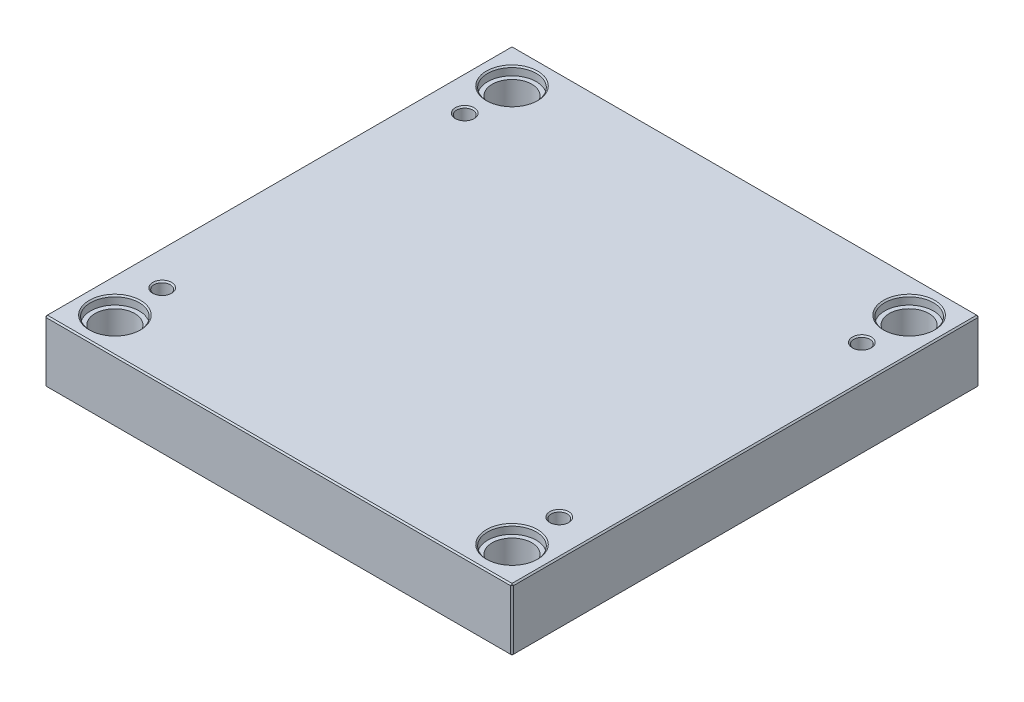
ISO-10303-21;
HEADER;
FILE_DESCRIPTION(('STEP AP214'),'2;1');
FILE_NAME('part.step','',(''),(''),'','','');
FILE_SCHEMA(('AUTOMOTIVE_DESIGN { 1 0 10303 214 1 1 1 1 }'));
ENDSEC;
DATA;
#1=APPLICATION_CONTEXT('core data for automotive mechanical design processes');
#2=APPLICATION_PROTOCOL_DEFINITION('international standard','automotive_design',2000,#1);
#3=PRODUCT_CONTEXT('',#1,'mechanical');
#4=PRODUCT('Part','Part','',(#3));
#5=PRODUCT_RELATED_PRODUCT_CATEGORY('part','',(#4));
#6=PRODUCT_DEFINITION_FORMATION('','',#4);
#7=PRODUCT_DEFINITION_CONTEXT('part definition',#1,'design');
#8=PRODUCT_DEFINITION('design','',#6,#7);
#9=PRODUCT_DEFINITION_SHAPE('','',#8);
#10=(LENGTH_UNIT() NAMED_UNIT(*) SI_UNIT(.MILLI.,.METRE.));
#11=(NAMED_UNIT(*) PLANE_ANGLE_UNIT() SI_UNIT($,.RADIAN.));
#12=(NAMED_UNIT(*) SI_UNIT($,.STERADIAN.) SOLID_ANGLE_UNIT());
#13=UNCERTAINTY_MEASURE_WITH_UNIT(LENGTH_MEASURE(1.E-05),#10,'distance_accuracy_value','');
#14=(GEOMETRIC_REPRESENTATION_CONTEXT(3) GLOBAL_UNCERTAINTY_ASSIGNED_CONTEXT((#13)) GLOBAL_UNIT_ASSIGNED_CONTEXT((#10,
#11,#12)) REPRESENTATION_CONTEXT('',''));
#15=CARTESIAN_POINT('',(0.,0.,0.));
#16=DIRECTION('',(0.,0.,1.));
#17=DIRECTION('',(1.,0.,0.));
#18=AXIS2_PLACEMENT_3D('',#15,#16,#17);
#19=CARTESIAN_POINT('',(-147.,0.,-147.));
#20=DIRECTION('',(0.,1.,0.));
#21=DIRECTION('',(0.,0.,1.));
#22=AXIS2_PLACEMENT_3D('',#19,#20,#21);
#23=CYLINDRICAL_SURFACE('',#22,14.7);
#24=CARTESIAN_POINT('',(-147.,0.999999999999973,-147.));
#25=DIRECTION('',(0.,1.,0.));
#26=DIRECTION('',(0.,0.,1.));
#27=AXIS2_PLACEMENT_3D('',#24,#25,#26);
#28=CIRCLE('',#27,14.7);
#29=CARTESIAN_POINT('',(-147.,0.999999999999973,-132.3));
#30=VERTEX_POINT('',#29);
#31=EDGE_CURVE('E472',#30,#30,#28,.F.);
#32=ORIENTED_EDGE('',*,*,#31,.T.);
#33=EDGE_LOOP('',(#32));
#34=FACE_BOUND('',#33,.T.);
#35=CARTESIAN_POINT('',(-147.,39.7,-147.));
#36=DIRECTION('',(0.,1.,0.));
#37=DIRECTION('',(0.,0.,1.));
#38=AXIS2_PLACEMENT_3D('',#35,#36,#37);
#39=CIRCLE('',#38,14.7);
#40=CARTESIAN_POINT('',(-147.,39.7,-132.3));
#41=VERTEX_POINT('',#40);
#42=EDGE_CURVE('E221',#41,#41,#39,.F.);
#43=ORIENTED_EDGE('',*,*,#42,.F.);
#44=EDGE_LOOP('',(#43));
#45=FACE_BOUND('',#44,.T.);
#46=ADVANCED_FACE('F16',(#34,#45),#23,.F.);
#47=CARTESIAN_POINT('',(147.,0.,-147.));
#48=DIRECTION('',(0.,1.,0.));
#49=DIRECTION('',(0.,0.,1.));
#50=AXIS2_PLACEMENT_3D('',#47,#48,#49);
#51=CYLINDRICAL_SURFACE('',#50,14.7);
#52=CARTESIAN_POINT('',(147.,0.999999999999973,-147.));
#53=DIRECTION('',(0.,1.,0.));
#54=DIRECTION('',(0.,0.,1.));
#55=AXIS2_PLACEMENT_3D('',#52,#53,#54);
#56=CIRCLE('',#55,14.7);
#57=CARTESIAN_POINT('',(147.,0.999999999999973,-132.3));
#58=VERTEX_POINT('',#57);
#59=EDGE_CURVE('E474',#58,#58,#56,.F.);
#60=ORIENTED_EDGE('',*,*,#59,.T.);
#61=EDGE_LOOP('',(#60));
#62=FACE_BOUND('',#61,.T.);
#63=CARTESIAN_POINT('',(147.,39.7,-147.));
#64=DIRECTION('',(0.,1.,0.));
#65=DIRECTION('',(0.,0.,1.));
#66=AXIS2_PLACEMENT_3D('',#63,#64,#65);
#67=CIRCLE('',#66,14.7);
#68=CARTESIAN_POINT('',(147.,39.7,-132.3));
#69=VERTEX_POINT('',#68);
#70=EDGE_CURVE('E218',#69,#69,#67,.F.);
#71=ORIENTED_EDGE('',*,*,#70,.F.);
#72=EDGE_LOOP('',(#71));
#73=FACE_BOUND('',#72,.T.);
#74=ADVANCED_FACE('F263',(#62,#73),#51,.F.);
#75=CARTESIAN_POINT('',(147.,0.,147.));
#76=DIRECTION('',(0.,1.,0.));
#77=DIRECTION('',(0.,0.,1.));
#78=AXIS2_PLACEMENT_3D('',#75,#76,#77);
#79=CYLINDRICAL_SURFACE('',#78,14.7);
#80=CARTESIAN_POINT('',(147.,0.999999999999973,147.));
#81=DIRECTION('',(0.,1.,0.));
#82=DIRECTION('',(0.,0.,1.));
#83=AXIS2_PLACEMENT_3D('',#80,#81,#82);
#84=CIRCLE('',#83,14.7);
#85=CARTESIAN_POINT('',(147.,0.999999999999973,161.7));
#86=VERTEX_POINT('',#85);
#87=EDGE_CURVE('E477',#86,#86,#84,.F.);
#88=ORIENTED_EDGE('',*,*,#87,.T.);
#89=EDGE_LOOP('',(#88));
#90=FACE_BOUND('',#89,.T.);
#91=CARTESIAN_POINT('',(147.,39.7,147.));
#92=DIRECTION('',(0.,1.,0.));
#93=DIRECTION('',(0.,0.,1.));
#94=AXIS2_PLACEMENT_3D('',#91,#92,#93);
#95=CIRCLE('',#94,14.7);
#96=CARTESIAN_POINT('',(147.,39.7,161.7));
#97=VERTEX_POINT('',#96);
#98=EDGE_CURVE('E214',#97,#97,#95,.F.);
#99=ORIENTED_EDGE('',*,*,#98,.F.);
#100=EDGE_LOOP('',(#99));
#101=FACE_BOUND('',#100,.T.);
#102=ADVANCED_FACE('F270',(#90,#101),#79,.F.);
#103=CARTESIAN_POINT('',(-147.,0.,147.));
#104=DIRECTION('',(0.,1.,0.));
#105=DIRECTION('',(0.,0.,1.));
#106=AXIS2_PLACEMENT_3D('',#103,#104,#105);
#107=CYLINDRICAL_SURFACE('',#106,14.7);
#108=CARTESIAN_POINT('',(-147.,0.999999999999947,147.));
#109=DIRECTION('',(0.,1.,0.));
#110=DIRECTION('',(0.,0.,1.));
#111=AXIS2_PLACEMENT_3D('',#108,#109,#110);
#112=CIRCLE('',#111,14.7);
#113=CARTESIAN_POINT('',(-147.,0.999999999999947,161.7));
#114=VERTEX_POINT('',#113);
#115=EDGE_CURVE('E480',#114,#114,#112,.F.);
#116=ORIENTED_EDGE('',*,*,#115,.T.);
#117=EDGE_LOOP('',(#116));
#118=FACE_BOUND('',#117,.T.);
#119=CARTESIAN_POINT('',(-147.,39.7,147.));
#120=DIRECTION('',(0.,1.,0.));
#121=DIRECTION('',(0.,0.,1.));
#122=AXIS2_PLACEMENT_3D('',#119,#120,#121);
#123=CIRCLE('',#122,14.7);
#124=CARTESIAN_POINT('',(-147.,39.7,161.7));
#125=VERTEX_POINT('',#124);
#126=EDGE_CURVE('E211',#125,#125,#123,.F.);
#127=ORIENTED_EDGE('',*,*,#126,.F.);
#128=EDGE_LOOP('',(#127));
#129=FACE_BOUND('',#128,.T.);
#130=ADVANCED_FACE('F277',(#118,#129),#107,.F.);
#131=CARTESIAN_POINT('',(-173.,46.,173.));
#132=DIRECTION('',(1.,0.,0.));
#133=DIRECTION('',(0.,0.,-1.));
#134=AXIS2_PLACEMENT_3D('',#131,#132,#133);
#135=PLANE('',#134);
#136=DIRECTION('',(0.,-1.,0.));
#137=VECTOR('',#136,1.);
#138=CARTESIAN_POINT('',(-173.,46.,-172.));
#139=LINE('',#138,#137);
#140=CARTESIAN_POINT('',(-173.,45.,-172.));
#141=VERTEX_POINT('',#140);
#142=CARTESIAN_POINT('',(-173.,1.,-172.));
#143=VERTEX_POINT('',#142);
#144=EDGE_CURVE('E487',#141,#143,#139,.T.);
#145=ORIENTED_EDGE('',*,*,#144,.T.);
#146=DIRECTION('',(0.,0.,1.));
#147=VECTOR('',#146,1.);
#148=CARTESIAN_POINT('',(-173.,1.,173.));
#149=LINE('',#148,#147);
#150=CARTESIAN_POINT('',(-173.,1.,172.));
#151=VERTEX_POINT('',#150);
#152=EDGE_CURVE('E490',#143,#151,#149,.T.);
#153=ORIENTED_EDGE('',*,*,#152,.T.);
#154=DIRECTION('',(0.,1.,0.));
#155=VECTOR('',#154,1.);
#156=CARTESIAN_POINT('',(-173.,46.,172.));
#157=LINE('',#156,#155);
#158=CARTESIAN_POINT('',(-173.,45.,172.));
#159=VERTEX_POINT('',#158);
#160=EDGE_CURVE('E485',#151,#159,#157,.T.);
#161=ORIENTED_EDGE('',*,*,#160,.T.);
#162=DIRECTION('',(0.,0.,-1.));
#163=VECTOR('',#162,1.);
#164=CARTESIAN_POINT('',(-173.,45.,-173.));
#165=LINE('',#164,#163);
#166=EDGE_CURVE('E483',#159,#141,#165,.T.);
#167=ORIENTED_EDGE('',*,*,#166,.T.);
#168=EDGE_LOOP('',(#145,#153,#161,#167));
#169=FACE_BOUND('',#168,.T.);
#170=ADVANCED_FACE('F298',(#169),#135,.F.);
#171=CARTESIAN_POINT('',(173.,46.,173.));
#172=DIRECTION('',(0.,0.,-1.));
#173=DIRECTION('',(-1.,0.,0.));
#174=AXIS2_PLACEMENT_3D('',#171,#172,#173);
#175=PLANE('',#174);
#176=DIRECTION('',(-1.,0.,0.));
#177=VECTOR('',#176,1.);
#178=CARTESIAN_POINT('',(-173.,45.,173.));
#179=LINE('',#178,#177);
#180=CARTESIAN_POINT('',(172.,45.,173.));
#181=VERTEX_POINT('',#180);
#182=CARTESIAN_POINT('',(-172.,45.,173.));
#183=VERTEX_POINT('',#182);
#184=EDGE_CURVE('E509',#181,#183,#179,.T.);
#185=ORIENTED_EDGE('',*,*,#184,.T.);
#186=DIRECTION('',(0.,-1.,0.));
#187=VECTOR('',#186,1.);
#188=CARTESIAN_POINT('',(-172.,46.,173.));
#189=LINE('',#188,#187);
#190=CARTESIAN_POINT('',(-172.,1.,173.));
#191=VERTEX_POINT('',#190);
#192=EDGE_CURVE('E515',#183,#191,#189,.T.);
#193=ORIENTED_EDGE('',*,*,#192,.T.);
#194=DIRECTION('',(1.,0.,0.));
#195=VECTOR('',#194,1.);
#196=CARTESIAN_POINT('',(173.,1.,173.));
#197=LINE('',#196,#195);
#198=CARTESIAN_POINT('',(172.,1.,173.));
#199=VERTEX_POINT('',#198);
#200=EDGE_CURVE('E513',#191,#199,#197,.T.);
#201=ORIENTED_EDGE('',*,*,#200,.T.);
#202=DIRECTION('',(0.,1.,0.));
#203=VECTOR('',#202,1.);
#204=CARTESIAN_POINT('',(172.,46.,173.));
#205=LINE('',#204,#203);
#206=EDGE_CURVE('E511',#199,#181,#205,.T.);
#207=ORIENTED_EDGE('',*,*,#206,.T.);
#208=EDGE_LOOP('',(#185,#193,#201,#207));
#209=FACE_BOUND('',#208,.T.);
#210=ADVANCED_FACE('F294',(#209),#175,.F.);
#211=CARTESIAN_POINT('',(173.,46.,173.));
#212=DIRECTION('',(-1.,0.,0.));
#213=DIRECTION('',(0.,0.,1.));
#214=AXIS2_PLACEMENT_3D('',#211,#212,#213);
#215=PLANE('',#214);
#216=DIRECTION('',(0.,0.,-1.));
#217=VECTOR('',#216,1.);
#218=CARTESIAN_POINT('',(173.,1.,173.));
#219=LINE('',#218,#217);
#220=CARTESIAN_POINT('',(173.,1.,172.));
#221=VERTEX_POINT('',#220);
#222=CARTESIAN_POINT('',(173.,1.,-172.));
#223=VERTEX_POINT('',#222);
#224=EDGE_CURVE('E504',#221,#223,#219,.T.);
#225=ORIENTED_EDGE('',*,*,#224,.T.);
#226=DIRECTION('',(0.,1.,0.));
#227=VECTOR('',#226,1.);
#228=CARTESIAN_POINT('',(173.,46.,-172.));
#229=LINE('',#228,#227);
#230=CARTESIAN_POINT('',(173.,45.,-172.));
#231=VERTEX_POINT('',#230);
#232=EDGE_CURVE('E506',#223,#231,#229,.T.);
#233=ORIENTED_EDGE('',*,*,#232,.T.);
#234=DIRECTION('',(0.,0.,1.));
#235=VECTOR('',#234,1.);
#236=CARTESIAN_POINT('',(173.,45.,173.));
#237=LINE('',#236,#235);
#238=CARTESIAN_POINT('',(173.,45.,172.));
#239=VERTEX_POINT('',#238);
#240=EDGE_CURVE('E500',#231,#239,#237,.T.);
#241=ORIENTED_EDGE('',*,*,#240,.T.);
#242=DIRECTION('',(0.,-1.,0.));
#243=VECTOR('',#242,1.);
#244=CARTESIAN_POINT('',(173.,46.,172.));
#245=LINE('',#244,#243);
#246=EDGE_CURVE('E502',#239,#221,#245,.T.);
#247=ORIENTED_EDGE('',*,*,#246,.T.);
#248=EDGE_LOOP('',(#225,#233,#241,#247));
#249=FACE_BOUND('',#248,.T.);
#250=ADVANCED_FACE('F290',(#249),#215,.F.);
#251=CARTESIAN_POINT('',(173.,46.,-173.));
#252=DIRECTION('',(0.,0.,1.));
#253=DIRECTION('',(1.,0.,0.));
#254=AXIS2_PLACEMENT_3D('',#251,#252,#253);
#255=PLANE('',#254);
#256=DIRECTION('',(0.,-1.,0.));
#257=VECTOR('',#256,1.);
#258=CARTESIAN_POINT('',(172.,46.,-173.));
#259=LINE('',#258,#257);
#260=CARTESIAN_POINT('',(172.,45.,-173.));
#261=VERTEX_POINT('',#260);
#262=CARTESIAN_POINT('',(172.,1.,-173.));
#263=VERTEX_POINT('',#262);
#264=EDGE_CURVE('E494',#261,#263,#259,.T.);
#265=ORIENTED_EDGE('',*,*,#264,.T.);
#266=DIRECTION('',(-1.,0.,0.));
#267=VECTOR('',#266,1.);
#268=CARTESIAN_POINT('',(173.,1.,-173.));
#269=LINE('',#268,#267);
#270=CARTESIAN_POINT('',(-172.,1.,-173.));
#271=VERTEX_POINT('',#270);
#272=EDGE_CURVE('E138',#263,#271,#269,.T.);
#273=ORIENTED_EDGE('',*,*,#272,.T.);
#274=DIRECTION('',(0.,1.,0.));
#275=VECTOR('',#274,1.);
#276=CARTESIAN_POINT('',(-172.,46.,-173.));
#277=LINE('',#276,#275);
#278=CARTESIAN_POINT('',(-172.,45.,-173.));
#279=VERTEX_POINT('',#278);
#280=EDGE_CURVE('E496',#271,#279,#277,.T.);
#281=ORIENTED_EDGE('',*,*,#280,.T.);
#282=DIRECTION('',(1.,0.,0.));
#283=VECTOR('',#282,1.);
#284=CARTESIAN_POINT('',(173.,45.,-173.));
#285=LINE('',#284,#283);
#286=EDGE_CURVE('E492',#279,#261,#285,.T.);
#287=ORIENTED_EDGE('',*,*,#286,.T.);
#288=EDGE_LOOP('',(#265,#273,#281,#287));
#289=FACE_BOUND('',#288,.T.);
#290=ADVANCED_FACE('F282',(#289),#255,.F.);
#291=CARTESIAN_POINT('',(0.,46.,0.));
#292=DIRECTION('',(0.,1.,0.));
#293=DIRECTION('',(0.,0.,1.));
#294=AXIS2_PLACEMENT_3D('',#291,#292,#293);
#295=PLANE('',#294);
#296=CARTESIAN_POINT('',(147.,46.,147.));
#297=DIRECTION('',(0.,1.,0.));
#298=DIRECTION('',(0.,0.,1.));
#299=AXIS2_PLACEMENT_3D('',#296,#297,#298);
#300=CIRCLE('',#299,19.);
#301=CARTESIAN_POINT('',(147.,46.,166.));
#302=VERTEX_POINT('',#301);
#303=EDGE_CURVE('E236',#302,#302,#300,.F.);
#304=ORIENTED_EDGE('',*,*,#303,.T.);
#305=EDGE_LOOP('',(#304));
#306=FACE_BOUND('',#305,.T.);
#307=CARTESIAN_POINT('',(-147.,46.,147.));
#308=DIRECTION('',(0.,1.,0.));
#309=DIRECTION('',(0.,0.,1.));
#310=AXIS2_PLACEMENT_3D('',#307,#308,#309);
#311=CIRCLE('',#310,19.);
#312=CARTESIAN_POINT('',(-147.,46.,166.));
#313=VERTEX_POINT('',#312);
#314=EDGE_CURVE('E233',#313,#313,#311,.F.);
#315=ORIENTED_EDGE('',*,*,#314,.T.);
#316=EDGE_LOOP('',(#315));
#317=FACE_BOUND('',#316,.T.);
#318=CARTESIAN_POINT('',(147.,46.,-147.));
#319=DIRECTION('',(0.,1.,0.));
#320=DIRECTION('',(0.,0.,1.));
#321=AXIS2_PLACEMENT_3D('',#318,#319,#320);
#322=CIRCLE('',#321,19.);
#323=CARTESIAN_POINT('',(147.,46.,-128.));
#324=VERTEX_POINT('',#323);
#325=EDGE_CURVE('E230',#324,#324,#322,.F.);
#326=ORIENTED_EDGE('',*,*,#325,.T.);
#327=EDGE_LOOP('',(#326));
#328=FACE_BOUND('',#327,.T.);
#329=CARTESIAN_POINT('',(-147.,46.,-147.));
#330=DIRECTION('',(0.,1.,0.));
#331=DIRECTION('',(0.,0.,1.));
#332=AXIS2_PLACEMENT_3D('',#329,#330,#331);
#333=CIRCLE('',#332,19.);
#334=CARTESIAN_POINT('',(-147.,46.,-128.));
#335=VERTEX_POINT('',#334);
#336=EDGE_CURVE('E227',#335,#335,#333,.F.);
#337=ORIENTED_EDGE('',*,*,#336,.T.);
#338=EDGE_LOOP('',(#337));
#339=FACE_BOUND('',#338,.T.);
#340=CARTESIAN_POINT('',(-147.,46.,112.));
#341=DIRECTION('',(0.,1.,0.));
#342=DIRECTION('',(0.,0.,1.));
#343=AXIS2_PLACEMENT_3D('',#340,#341,#342);
#344=CIRCLE('',#343,7.);
#345=CARTESIAN_POINT('',(-147.,46.,119.));
#346=VERTEX_POINT('',#345);
#347=EDGE_CURVE('E198',#346,#346,#344,.F.);
#348=ORIENTED_EDGE('',*,*,#347,.T.);
#349=EDGE_LOOP('',(#348));
#350=FACE_BOUND('',#349,.T.);
#351=CARTESIAN_POINT('',(147.,46.,112.));
#352=DIRECTION('',(0.,1.,0.));
#353=DIRECTION('',(0.,0.,1.));
#354=AXIS2_PLACEMENT_3D('',#351,#352,#353);
#355=CIRCLE('',#354,7.);
#356=CARTESIAN_POINT('',(147.,46.,119.));
#357=VERTEX_POINT('',#356);
#358=EDGE_CURVE('E195',#357,#357,#355,.F.);
#359=ORIENTED_EDGE('',*,*,#358,.T.);
#360=EDGE_LOOP('',(#359));
#361=FACE_BOUND('',#360,.T.);
#362=CARTESIAN_POINT('',(147.,46.,-112.));
#363=DIRECTION('',(0.,1.,0.));
#364=DIRECTION('',(0.,0.,1.));
#365=AXIS2_PLACEMENT_3D('',#362,#363,#364);
#366=CIRCLE('',#365,7.);
#367=CARTESIAN_POINT('',(147.,46.,-105.));
#368=VERTEX_POINT('',#367);
#369=EDGE_CURVE('E192',#368,#368,#366,.F.);
#370=ORIENTED_EDGE('',*,*,#369,.T.);
#371=EDGE_LOOP('',(#370));
#372=FACE_BOUND('',#371,.T.);
#373=CARTESIAN_POINT('',(-147.,46.,-112.));
#374=DIRECTION('',(0.,1.,0.));
#375=DIRECTION('',(0.,0.,1.));
#376=AXIS2_PLACEMENT_3D('',#373,#374,#375);
#377=CIRCLE('',#376,7.);
#378=CARTESIAN_POINT('',(-147.,46.,-105.));
#379=VERTEX_POINT('',#378);
#380=EDGE_CURVE('E188',#379,#379,#377,.F.);
#381=ORIENTED_EDGE('',*,*,#380,.T.);
#382=EDGE_LOOP('',(#381));
#383=FACE_BOUND('',#382,.T.);
#384=DIRECTION('',(0.,0.,-1.));
#385=VECTOR('',#384,1.);
#386=CARTESIAN_POINT('',(172.,46.,-173.));
#387=LINE('',#386,#385);
#388=CARTESIAN_POINT('',(172.,46.,172.));
#389=VERTEX_POINT('',#388);
#390=CARTESIAN_POINT('',(172.,46.,-172.));
#391=VERTEX_POINT('',#390);
#392=EDGE_CURVE('E31',#389,#391,#387,.T.);
#393=ORIENTED_EDGE('',*,*,#392,.T.);
#394=DIRECTION('',(-1.,0.,0.));
#395=VECTOR('',#394,1.);
#396=CARTESIAN_POINT('',(-173.,46.,-172.));
#397=LINE('',#396,#395);
#398=CARTESIAN_POINT('',(-172.,46.,-172.));
#399=VERTEX_POINT('',#398);
#400=EDGE_CURVE('E189',#391,#399,#397,.T.);
#401=ORIENTED_EDGE('',*,*,#400,.T.);
#402=DIRECTION('',(0.,0.,1.));
#403=VECTOR('',#402,1.);
#404=CARTESIAN_POINT('',(-172.,46.,173.));
#405=LINE('',#404,#403);
#406=CARTESIAN_POINT('',(-172.,46.,172.));
#407=VERTEX_POINT('',#406);
#408=EDGE_CURVE('E518',#399,#407,#405,.T.);
#409=ORIENTED_EDGE('',*,*,#408,.T.);
#410=DIRECTION('',(1.,0.,0.));
#411=VECTOR('',#410,1.);
#412=CARTESIAN_POINT('',(173.,46.,172.));
#413=LINE('',#412,#411);
#414=EDGE_CURVE('E36',#407,#389,#413,.T.);
#415=ORIENTED_EDGE('',*,*,#414,.T.);
#416=EDGE_LOOP('',(#393,#401,#409,#415));
#417=FACE_BOUND('',#416,.T.);
#418=ADVANCED_FACE('F279',(#306,#317,#328,#339,#350,#361,#372,#383,#417),#295,.T.);
#419=CARTESIAN_POINT('',(0.,0.,0.));
#420=DIRECTION('',(0.,1.,0.));
#421=DIRECTION('',(0.,0.,1.));
#422=AXIS2_PLACEMENT_3D('',#419,#420,#421);
#423=PLANE('',#422);
#424=CARTESIAN_POINT('',(-147.,0.,-147.));
#425=DIRECTION('',(0.,1.,0.));
#426=DIRECTION('',(0.,0.,1.));
#427=AXIS2_PLACEMENT_3D('',#424,#425,#426);
#428=CIRCLE('',#427,15.7);
#429=CARTESIAN_POINT('',(-147.,0.,-131.3));
#430=VERTEX_POINT('',#429);
#431=EDGE_CURVE('E469',#430,#430,#428,.T.);
#432=ORIENTED_EDGE('',*,*,#431,.T.);
#433=EDGE_LOOP('',(#432));
#434=FACE_BOUND('',#433,.T.);
#435=CARTESIAN_POINT('',(147.,0.,-147.));
#436=DIRECTION('',(0.,1.,0.));
#437=DIRECTION('',(0.,0.,1.));
#438=AXIS2_PLACEMENT_3D('',#435,#436,#437);
#439=CIRCLE('',#438,15.7);
#440=CARTESIAN_POINT('',(147.,0.,-131.3));
#441=VERTEX_POINT('',#440);
#442=EDGE_CURVE('E466',#441,#441,#439,.T.);
#443=ORIENTED_EDGE('',*,*,#442,.T.);
#444=EDGE_LOOP('',(#443));
#445=FACE_BOUND('',#444,.T.);
#446=CARTESIAN_POINT('',(147.,0.,147.));
#447=DIRECTION('',(0.,1.,0.));
#448=DIRECTION('',(0.,0.,1.));
#449=AXIS2_PLACEMENT_3D('',#446,#447,#448);
#450=CIRCLE('',#449,15.7);
#451=CARTESIAN_POINT('',(147.,0.,162.7));
#452=VERTEX_POINT('',#451);
#453=EDGE_CURVE('E463',#452,#452,#450,.T.);
#454=ORIENTED_EDGE('',*,*,#453,.T.);
#455=EDGE_LOOP('',(#454));
#456=FACE_BOUND('',#455,.T.);
#457=CARTESIAN_POINT('',(-147.,0.,147.));
#458=DIRECTION('',(0.,1.,0.));
#459=DIRECTION('',(0.,0.,1.));
#460=AXIS2_PLACEMENT_3D('',#457,#458,#459);
#461=CIRCLE('',#460,15.7);
#462=CARTESIAN_POINT('',(-147.,0.,162.7));
#463=VERTEX_POINT('',#462);
#464=EDGE_CURVE('E460',#463,#463,#461,.T.);
#465=ORIENTED_EDGE('',*,*,#464,.T.);
#466=EDGE_LOOP('',(#465));
#467=FACE_BOUND('',#466,.T.);
#468=DIRECTION('',(0.,0.,1.));
#469=VECTOR('',#468,1.);
#470=CARTESIAN_POINT('',(172.,0.,0.));
#471=LINE('',#470,#469);
#472=CARTESIAN_POINT('',(172.,0.,-172.));
#473=VERTEX_POINT('',#472);
#474=CARTESIAN_POINT('',(172.,0.,172.));
#475=VERTEX_POINT('',#474);
#476=EDGE_CURVE('E108',#473,#475,#471,.T.);
#477=ORIENTED_EDGE('',*,*,#476,.T.);
#478=DIRECTION('',(-1.,0.,0.));
#479=VECTOR('',#478,1.);
#480=CARTESIAN_POINT('',(0.,0.,172.));
#481=LINE('',#480,#479);
#482=CARTESIAN_POINT('',(-172.,0.,172.));
#483=VERTEX_POINT('',#482);
#484=EDGE_CURVE('E458',#475,#483,#481,.T.);
#485=ORIENTED_EDGE('',*,*,#484,.T.);
#486=DIRECTION('',(0.,0.,-1.));
#487=VECTOR('',#486,1.);
#488=CARTESIAN_POINT('',(-172.,0.,0.));
#489=LINE('',#488,#487);
#490=CARTESIAN_POINT('',(-172.,0.,-172.));
#491=VERTEX_POINT('',#490);
#492=EDGE_CURVE('E110',#483,#491,#489,.T.);
#493=ORIENTED_EDGE('',*,*,#492,.T.);
#494=DIRECTION('',(1.,0.,0.));
#495=VECTOR('',#494,1.);
#496=CARTESIAN_POINT('',(0.,0.,-172.));
#497=LINE('',#496,#495);
#498=EDGE_CURVE('E104',#491,#473,#497,.T.);
#499=ORIENTED_EDGE('',*,*,#498,.T.);
#500=EDGE_LOOP('',(#477,#485,#493,#499));
#501=FACE_BOUND('',#500,.T.);
#502=ADVANCED_FACE('F106',(#434,#445,#456,#467,#501),#423,.F.);
#503=CARTESIAN_POINT('',(-147.,0.,-147.));
#504=DIRECTION('',(0.,-1.,0.));
#505=DIRECTION('',(0.,0.,-1.));
#506=AXIS2_PLACEMENT_3D('',#503,#504,#505);
#507=CONICAL_SURFACE('',#506,15.7,0.78539816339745);
#508=ORIENTED_EDGE('',*,*,#31,.F.);
#509=EDGE_LOOP('',(#508));
#510=FACE_BOUND('',#509,.T.);
#511=ORIENTED_EDGE('',*,*,#431,.F.);
#512=EDGE_LOOP('',(#511));
#513=FACE_BOUND('',#512,.T.);
#514=ADVANCED_FACE('F286',(#510,#513),#507,.F.);
#515=CARTESIAN_POINT('',(147.,0.,-147.));
#516=DIRECTION('',(0.,-1.,0.));
#517=DIRECTION('',(0.,0.,-1.));
#518=AXIS2_PLACEMENT_3D('',#515,#516,#517);
#519=CONICAL_SURFACE('',#518,15.7,0.78539816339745);
#520=ORIENTED_EDGE('',*,*,#59,.F.);
#521=EDGE_LOOP('',(#520));
#522=FACE_BOUND('',#521,.T.);
#523=ORIENTED_EDGE('',*,*,#442,.F.);
#524=EDGE_LOOP('',(#523));
#525=FACE_BOUND('',#524,.T.);
#526=ADVANCED_FACE('F305',(#522,#525),#519,.F.);
#527=CARTESIAN_POINT('',(147.,0.,147.));
#528=DIRECTION('',(0.,-1.,0.));
#529=DIRECTION('',(0.,0.,-1.));
#530=AXIS2_PLACEMENT_3D('',#527,#528,#529);
#531=CONICAL_SURFACE('',#530,15.7,0.78539816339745);
#532=ORIENTED_EDGE('',*,*,#87,.F.);
#533=EDGE_LOOP('',(#532));
#534=FACE_BOUND('',#533,.T.);
#535=ORIENTED_EDGE('',*,*,#453,.F.);
#536=EDGE_LOOP('',(#535));
#537=FACE_BOUND('',#536,.T.);
#538=ADVANCED_FACE('F309',(#534,#537),#531,.F.);
#539=CARTESIAN_POINT('',(-147.,0.,147.));
#540=DIRECTION('',(0.,-1.,0.));
#541=DIRECTION('',(0.,0.,-1.));
#542=AXIS2_PLACEMENT_3D('',#539,#540,#541);
#543=CONICAL_SURFACE('',#542,15.7,0.78539816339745);
#544=ORIENTED_EDGE('',*,*,#115,.F.);
#545=EDGE_LOOP('',(#544));
#546=FACE_BOUND('',#545,.T.);
#547=ORIENTED_EDGE('',*,*,#464,.F.);
#548=EDGE_LOOP('',(#547));
#549=FACE_BOUND('',#548,.T.);
#550=ADVANCED_FACE('F313',(#546,#549),#543,.F.);
#551=CARTESIAN_POINT('',(173.,46.,172.));
#552=DIRECTION('',(-0.707106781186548,0.,-0.707106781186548));
#553=DIRECTION('',(0.,-1.,0.));
#554=AXIS2_PLACEMENT_3D('',#551,#552,#553);
#555=PLANE('',#554);
#556=DIRECTION('',(-0.707106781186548,0.,0.707106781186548));
#557=VECTOR('',#556,1.);
#558=CARTESIAN_POINT('',(172.,45.,173.));
#559=LINE('',#558,#557);
#560=EDGE_CURVE('E126',#181,#239,#559,.F.);
#561=ORIENTED_EDGE('',*,*,#560,.F.);
#562=ORIENTED_EDGE('',*,*,#206,.F.);
#563=DIRECTION('',(0.707106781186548,0.,-0.707106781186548));
#564=VECTOR('',#563,1.);
#565=CARTESIAN_POINT('',(172.,1.,173.));
#566=LINE('',#565,#564);
#567=EDGE_CURVE('E180',#221,#199,#566,.F.);
#568=ORIENTED_EDGE('',*,*,#567,.F.);
#569=ORIENTED_EDGE('',*,*,#246,.F.);
#570=EDGE_LOOP('',(#561,#562,#568,#569));
#571=FACE_BOUND('',#570,.T.);
#572=ADVANCED_FACE('F317',(#571),#555,.F.);
#573=CARTESIAN_POINT('',(172.,45.,173.));
#574=DIRECTION('',(0.577350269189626,0.577350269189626,0.577350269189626));
#575=DIRECTION('',(0.707106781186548,0.,-0.707106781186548));
#576=AXIS2_PLACEMENT_3D('',#573,#574,#575);
#577=PLANE('',#576);
#578=DIRECTION('',(0.,-0.707106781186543,0.707106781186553));
#579=VECTOR('',#578,1.);
#580=CARTESIAN_POINT('',(172.,45.,173.));
#581=LINE('',#580,#579);
#582=EDGE_CURVE('E175',#181,#389,#581,.F.);
#583=ORIENTED_EDGE('',*,*,#582,.F.);
#584=ORIENTED_EDGE('',*,*,#560,.T.);
#585=DIRECTION('',(-0.707106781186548,0.707106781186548,0.));
#586=VECTOR('',#585,1.);
#587=CARTESIAN_POINT('',(172.5,45.5,172.));
#588=LINE('',#587,#586);
#589=EDGE_CURVE('E177',#389,#239,#588,.F.);
#590=ORIENTED_EDGE('',*,*,#589,.F.);
#591=EDGE_LOOP('',(#583,#584,#590));
#592=FACE_BOUND('',#591,.T.);
#593=ADVANCED_FACE('F385',(#592),#577,.T.);
#594=CARTESIAN_POINT('',(172.,1.,173.));
#595=DIRECTION('',(0.57735026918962,-0.577350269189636,0.57735026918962));
#596=DIRECTION('',(0.,-0.707106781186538,-0.707106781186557));
#597=AXIS2_PLACEMENT_3D('',#594,#595,#596);
#598=PLANE('',#597);
#599=DIRECTION('',(-0.707106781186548,-0.707106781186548,0.));
#600=VECTOR('',#599,1.);
#601=CARTESIAN_POINT('',(172.5,0.500000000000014,172.));
#602=LINE('',#601,#600);
#603=EDGE_CURVE('E124',#221,#475,#602,.T.);
#604=ORIENTED_EDGE('',*,*,#603,.F.);
#605=ORIENTED_EDGE('',*,*,#567,.T.);
#606=DIRECTION('',(0.,0.707106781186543,0.707106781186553));
#607=VECTOR('',#606,1.);
#608=CARTESIAN_POINT('',(172.,1.,173.));
#609=LINE('',#608,#607);
#610=EDGE_CURVE('E172',#475,#199,#609,.T.);
#611=ORIENTED_EDGE('',*,*,#610,.F.);
#612=EDGE_LOOP('',(#604,#605,#611));
#613=FACE_BOUND('',#612,.T.);
#614=ADVANCED_FACE('F381',(#613),#598,.T.);
#615=CARTESIAN_POINT('',(172.,46.,0.));
#616=DIRECTION('',(0.707106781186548,0.707106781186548,0.));
#617=DIRECTION('',(0.,0.,1.));
#618=AXIS2_PLACEMENT_3D('',#615,#616,#617);
#619=PLANE('',#618);
#620=ORIENTED_EDGE('',*,*,#589,.T.);
#621=ORIENTED_EDGE('',*,*,#240,.F.);
#622=DIRECTION('',(0.707106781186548,-0.707106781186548,0.));
#623=VECTOR('',#622,1.);
#624=CARTESIAN_POINT('',(173.,45.,-172.));
#625=LINE('',#624,#623);
#626=EDGE_CURVE('E166',#391,#231,#625,.T.);
#627=ORIENTED_EDGE('',*,*,#626,.F.);
#628=ORIENTED_EDGE('',*,*,#392,.F.);
#629=EDGE_LOOP('',(#620,#621,#627,#628));
#630=FACE_BOUND('',#629,.T.);
#631=ADVANCED_FACE('F377',(#630),#619,.T.);
#632=CARTESIAN_POINT('',(0.,46.,172.));
#633=DIRECTION('',(0.,0.707106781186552,0.707106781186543));
#634=DIRECTION('',(-1.,0.,0.));
#635=AXIS2_PLACEMENT_3D('',#632,#633,#634);
#636=PLANE('',#635);
#637=ORIENTED_EDGE('',*,*,#582,.T.);
#638=ORIENTED_EDGE('',*,*,#414,.F.);
#639=DIRECTION('',(0.,0.707106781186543,-0.707106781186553));
#640=VECTOR('',#639,1.);
#641=CARTESIAN_POINT('',(-172.,45.5,172.5));
#642=LINE('',#641,#640);
#643=EDGE_CURVE('E163',#183,#407,#642,.T.);
#644=ORIENTED_EDGE('',*,*,#643,.F.);
#645=ORIENTED_EDGE('',*,*,#184,.F.);
#646=EDGE_LOOP('',(#637,#638,#644,#645));
#647=FACE_BOUND('',#646,.T.);
#648=ADVANCED_FACE('F373',(#647),#636,.T.);
#649=CARTESIAN_POINT('',(-172.,46.,173.));
#650=DIRECTION('',(0.707106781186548,0.,-0.707106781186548));
#651=DIRECTION('',(0.,-1.,0.));
#652=AXIS2_PLACEMENT_3D('',#649,#650,#651);
#653=PLANE('',#652);
#654=DIRECTION('',(0.707106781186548,0.,0.707106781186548));
#655=VECTOR('',#654,1.);
#656=CARTESIAN_POINT('',(-172.,1.,173.));
#657=LINE('',#656,#655);
#658=EDGE_CURVE('E157',#191,#151,#657,.F.);
#659=ORIENTED_EDGE('',*,*,#658,.F.);
#660=ORIENTED_EDGE('',*,*,#192,.F.);
#661=DIRECTION('',(-0.707106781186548,0.,-0.707106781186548));
#662=VECTOR('',#661,1.);
#663=CARTESIAN_POINT('',(-173.,45.,172.));
#664=LINE('',#663,#662);
#665=EDGE_CURVE('E160',#159,#183,#664,.F.);
#666=ORIENTED_EDGE('',*,*,#665,.F.);
#667=ORIENTED_EDGE('',*,*,#160,.F.);
#668=EDGE_LOOP('',(#659,#660,#666,#667));
#669=FACE_BOUND('',#668,.T.);
#670=ADVANCED_FACE('F369',(#669),#653,.F.);
#671=CARTESIAN_POINT('',(173.,1.,173.));
#672=DIRECTION('',(0.,0.707106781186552,-0.707106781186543));
#673=DIRECTION('',(1.,0.,0.));
#674=AXIS2_PLACEMENT_3D('',#671,#672,#673);
#675=PLANE('',#674);
#676=ORIENTED_EDGE('',*,*,#610,.T.);
#677=ORIENTED_EDGE('',*,*,#200,.F.);
#678=DIRECTION('',(0.,-0.707106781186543,-0.707106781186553));
#679=VECTOR('',#678,1.);
#680=CARTESIAN_POINT('',(-172.,1.,173.));
#681=LINE('',#680,#679);
#682=EDGE_CURVE('E135',#483,#191,#681,.F.);
#683=ORIENTED_EDGE('',*,*,#682,.F.);
#684=ORIENTED_EDGE('',*,*,#484,.F.);
#685=EDGE_LOOP('',(#676,#677,#683,#684));
#686=FACE_BOUND('',#685,.T.);
#687=ADVANCED_FACE('F366',(#686),#675,.F.);
#688=CARTESIAN_POINT('',(173.,1.,173.));
#689=DIRECTION('',(-0.707106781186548,0.707106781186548,0.));
#690=DIRECTION('',(0.,0.,-1.));
#691=AXIS2_PLACEMENT_3D('',#688,#689,#690);
#692=PLANE('',#691);
#693=ORIENTED_EDGE('',*,*,#603,.T.);
#694=ORIENTED_EDGE('',*,*,#476,.F.);
#695=DIRECTION('',(0.707106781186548,0.707106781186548,0.));
#696=VECTOR('',#695,1.);
#697=CARTESIAN_POINT('',(172.5,0.5,-172.));
#698=LINE('',#697,#696);
#699=EDGE_CURVE('E121',#223,#473,#698,.F.);
#700=ORIENTED_EDGE('',*,*,#699,.F.);
#701=ORIENTED_EDGE('',*,*,#224,.F.);
#702=EDGE_LOOP('',(#693,#694,#700,#701));
#703=FACE_BOUND('',#702,.T.);
#704=ADVANCED_FACE('F119',(#703),#692,.F.);
#705=CARTESIAN_POINT('',(172.,46.,-173.));
#706=DIRECTION('',(-0.707106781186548,0.,0.707106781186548));
#707=DIRECTION('',(0.,-1.,0.));
#708=AXIS2_PLACEMENT_3D('',#705,#706,#707);
#709=PLANE('',#708);
#710=DIRECTION('',(0.707106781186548,0.,0.707106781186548));
#711=VECTOR('',#710,1.);
#712=CARTESIAN_POINT('',(173.,45.,-172.));
#713=LINE('',#712,#711);
#714=EDGE_CURVE('E168',#231,#261,#713,.F.);
#715=ORIENTED_EDGE('',*,*,#714,.F.);
#716=ORIENTED_EDGE('',*,*,#232,.F.);
#717=DIRECTION('',(-0.707106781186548,0.,-0.707106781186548));
#718=VECTOR('',#717,1.);
#719=CARTESIAN_POINT('',(172.,1.,-173.));
#720=LINE('',#719,#718);
#721=EDGE_CURVE('E134',#263,#223,#720,.F.);
#722=ORIENTED_EDGE('',*,*,#721,.F.);
#723=ORIENTED_EDGE('',*,*,#264,.F.);
#724=EDGE_LOOP('',(#715,#716,#722,#723));
#725=FACE_BOUND('',#724,.T.);
#726=ADVANCED_FACE('F359',(#725),#709,.F.);
#727=CARTESIAN_POINT('',(173.,45.,-172.));
#728=DIRECTION('',(0.577350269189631,0.577350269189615,-0.577350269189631));
#729=DIRECTION('',(-0.707106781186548,0.,-0.707106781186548));
#730=AXIS2_PLACEMENT_3D('',#727,#728,#729);
#731=PLANE('',#730);
#732=ORIENTED_EDGE('',*,*,#626,.T.);
#733=ORIENTED_EDGE('',*,*,#714,.T.);
#734=DIRECTION('',(0.,0.707106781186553,0.707106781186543));
#735=VECTOR('',#734,1.);
#736=CARTESIAN_POINT('',(172.,45.5,-172.5));
#737=LINE('',#736,#735);
#738=EDGE_CURVE('E152',#391,#261,#737,.F.);
#739=ORIENTED_EDGE('',*,*,#738,.F.);
#740=EDGE_LOOP('',(#732,#733,#739));
#741=FACE_BOUND('',#740,.T.);
#742=ADVANCED_FACE('F355',(#741),#731,.T.);
#743=CARTESIAN_POINT('',(-173.,45.,172.));
#744=DIRECTION('',(-0.577350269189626,0.577350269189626,0.577350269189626));
#745=DIRECTION('',(0.707106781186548,0.,0.707106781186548));
#746=AXIS2_PLACEMENT_3D('',#743,#744,#745);
#747=PLANE('',#746);
#748=ORIENTED_EDGE('',*,*,#665,.T.);
#749=ORIENTED_EDGE('',*,*,#643,.T.);
#750=DIRECTION('',(-0.707106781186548,-0.707106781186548,0.));
#751=VECTOR('',#750,1.);
#752=CARTESIAN_POINT('',(-173.,45.,172.));
#753=LINE('',#752,#751);
#754=EDGE_CURVE('E143',#159,#407,#753,.F.);
#755=ORIENTED_EDGE('',*,*,#754,.F.);
#756=EDGE_LOOP('',(#748,#749,#755));
#757=FACE_BOUND('',#756,.T.);
#758=ADVANCED_FACE('F351',(#757),#747,.T.);
#759=CARTESIAN_POINT('',(-172.,1.,173.));
#760=DIRECTION('',(-0.57735026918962,-0.577350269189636,0.57735026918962));
#761=DIRECTION('',(0.,-0.707106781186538,-0.707106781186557));
#762=AXIS2_PLACEMENT_3D('',#759,#760,#761);
#763=PLANE('',#762);
#764=ORIENTED_EDGE('',*,*,#682,.T.);
#765=ORIENTED_EDGE('',*,*,#658,.T.);
#766=DIRECTION('',(-0.707106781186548,0.707106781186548,0.));
#767=VECTOR('',#766,1.);
#768=CARTESIAN_POINT('',(-172.5,0.500000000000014,172.));
#769=LINE('',#768,#767);
#770=EDGE_CURVE('E139',#483,#151,#769,.T.);
#771=ORIENTED_EDGE('',*,*,#770,.F.);
#772=EDGE_LOOP('',(#764,#765,#771));
#773=FACE_BOUND('',#772,.T.);
#774=ADVANCED_FACE('F348',(#773),#763,.T.);
#775=CARTESIAN_POINT('',(172.,1.,-173.));
#776=DIRECTION('',(0.577350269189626,-0.577350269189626,-0.577350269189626));
#777=DIRECTION('',(-0.707106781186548,0.,-0.707106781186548));
#778=AXIS2_PLACEMENT_3D('',#775,#776,#777);
#779=PLANE('',#778);
#780=ORIENTED_EDGE('',*,*,#721,.T.);
#781=ORIENTED_EDGE('',*,*,#699,.T.);
#782=DIRECTION('',(0.,-0.707106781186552,0.707106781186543));
#783=VECTOR('',#782,1.);
#784=CARTESIAN_POINT('',(172.,1.,-173.));
#785=LINE('',#784,#783);
#786=EDGE_CURVE('E131',#263,#473,#785,.T.);
#787=ORIENTED_EDGE('',*,*,#786,.F.);
#788=EDGE_LOOP('',(#780,#781,#787));
#789=FACE_BOUND('',#788,.T.);
#790=ADVANCED_FACE('F130',(#789),#779,.T.);
#791=CARTESIAN_POINT('',(0.,46.,-172.));
#792=DIRECTION('',(0.,0.707106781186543,-0.707106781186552));
#793=DIRECTION('',(1.,0.,0.));
#794=AXIS2_PLACEMENT_3D('',#791,#792,#793);
#795=PLANE('',#794);
#796=ORIENTED_EDGE('',*,*,#738,.T.);
#797=ORIENTED_EDGE('',*,*,#286,.F.);
#798=DIRECTION('',(0.,-0.707106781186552,-0.707106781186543));
#799=VECTOR('',#798,1.);
#800=CARTESIAN_POINT('',(-172.,45.,-173.));
#801=LINE('',#800,#799);
#802=EDGE_CURVE('E140',#399,#279,#801,.T.);
#803=ORIENTED_EDGE('',*,*,#802,.F.);
#804=ORIENTED_EDGE('',*,*,#400,.F.);
#805=EDGE_LOOP('',(#796,#797,#803,#804));
#806=FACE_BOUND('',#805,.T.);
#807=ADVANCED_FACE('F341',(#806),#795,.T.);
#808=CARTESIAN_POINT('',(-172.,46.,0.));
#809=DIRECTION('',(-0.707106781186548,0.707106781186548,0.));
#810=DIRECTION('',(0.,0.,-1.));
#811=AXIS2_PLACEMENT_3D('',#808,#809,#810);
#812=PLANE('',#811);
#813=ORIENTED_EDGE('',*,*,#754,.T.);
#814=ORIENTED_EDGE('',*,*,#408,.F.);
#815=DIRECTION('',(0.707106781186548,0.707106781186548,0.));
#816=VECTOR('',#815,1.);
#817=CARTESIAN_POINT('',(-172.5,45.5,-172.));
#818=LINE('',#817,#816);
#819=EDGE_CURVE('E146',#141,#399,#818,.T.);
#820=ORIENTED_EDGE('',*,*,#819,.F.);
#821=ORIENTED_EDGE('',*,*,#166,.F.);
#822=EDGE_LOOP('',(#813,#814,#820,#821));
#823=FACE_BOUND('',#822,.T.);
#824=ADVANCED_FACE('F337',(#823),#812,.T.);
#825=CARTESIAN_POINT('',(-173.,1.,173.));
#826=DIRECTION('',(0.707106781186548,0.707106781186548,0.));
#827=DIRECTION('',(0.,0.,1.));
#828=AXIS2_PLACEMENT_3D('',#825,#826,#827);
#829=PLANE('',#828);
#830=ORIENTED_EDGE('',*,*,#770,.T.);
#831=ORIENTED_EDGE('',*,*,#152,.F.);
#832=DIRECTION('',(0.707106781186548,-0.707106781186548,0.));
#833=VECTOR('',#832,1.);
#834=CARTESIAN_POINT('',(-173.,1.,-172.));
#835=LINE('',#834,#833);
#836=EDGE_CURVE('E529',#491,#143,#835,.F.);
#837=ORIENTED_EDGE('',*,*,#836,.F.);
#838=ORIENTED_EDGE('',*,*,#492,.F.);
#839=EDGE_LOOP('',(#830,#831,#837,#838));
#840=FACE_BOUND('',#839,.T.);
#841=ADVANCED_FACE('F334',(#840),#829,.F.);
#842=CARTESIAN_POINT('',(173.,1.,-173.));
#843=DIRECTION('',(0.,0.707106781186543,0.707106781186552));
#844=DIRECTION('',(-1.,0.,0.));
#845=AXIS2_PLACEMENT_3D('',#842,#843,#844);
#846=PLANE('',#845);
#847=ORIENTED_EDGE('',*,*,#786,.T.);
#848=ORIENTED_EDGE('',*,*,#498,.F.);
#849=DIRECTION('',(0.,0.707106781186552,-0.707106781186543));
#850=VECTOR('',#849,1.);
#851=CARTESIAN_POINT('',(-172.,0.500000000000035,-172.5));
#852=LINE('',#851,#850);
#853=EDGE_CURVE('E526',#271,#491,#852,.F.);
#854=ORIENTED_EDGE('',*,*,#853,.F.);
#855=ORIENTED_EDGE('',*,*,#272,.F.);
#856=EDGE_LOOP('',(#847,#848,#854,#855));
#857=FACE_BOUND('',#856,.T.);
#858=ADVANCED_FACE('F137',(#857),#846,.F.);
#859=CARTESIAN_POINT('',(-172.,45.,-173.));
#860=DIRECTION('',(-0.57735026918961,0.577350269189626,-0.577350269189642));
#861=DIRECTION('',(0.,0.707106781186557,0.707106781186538));
#862=AXIS2_PLACEMENT_3D('',#859,#860,#861);
#863=PLANE('',#862);
#864=ORIENTED_EDGE('',*,*,#819,.T.);
#865=ORIENTED_EDGE('',*,*,#802,.T.);
#866=DIRECTION('',(0.707106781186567,0.,-0.707106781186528));
#867=VECTOR('',#866,1.);
#868=CARTESIAN_POINT('',(-172.,45.,-173.));
#869=LINE('',#868,#867);
#870=EDGE_CURVE('E524',#141,#279,#869,.T.);
#871=ORIENTED_EDGE('',*,*,#870,.F.);
#872=EDGE_LOOP('',(#864,#865,#871));
#873=FACE_BOUND('',#872,.T.);
#874=ADVANCED_FACE('F327',(#873),#863,.T.);
#875=CARTESIAN_POINT('',(-173.,1.,-172.));
#876=DIRECTION('',(-0.577350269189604,-0.577350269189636,-0.577350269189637));
#877=DIRECTION('',(0.,0.707106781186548,-0.707106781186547));
#878=AXIS2_PLACEMENT_3D('',#875,#876,#877);
#879=PLANE('',#878);
#880=ORIENTED_EDGE('',*,*,#853,.T.);
#881=ORIENTED_EDGE('',*,*,#836,.T.);
#882=DIRECTION('',(-0.707106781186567,0.,0.707106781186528));
#883=VECTOR('',#882,1.);
#884=CARTESIAN_POINT('',(-173.,1.,-172.));
#885=LINE('',#884,#883);
#886=EDGE_CURVE('E455',#271,#143,#885,.T.);
#887=ORIENTED_EDGE('',*,*,#886,.F.);
#888=EDGE_LOOP('',(#880,#881,#887));
#889=FACE_BOUND('',#888,.T.);
#890=ADVANCED_FACE('F323',(#889),#879,.T.);
#891=CARTESIAN_POINT('',(-173.,46.,-172.));
#892=DIRECTION('',(0.707106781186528,0.,0.707106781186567));
#893=DIRECTION('',(0.,-1.,0.));
#894=AXIS2_PLACEMENT_3D('',#891,#892,#893);
#895=PLANE('',#894);
#896=ORIENTED_EDGE('',*,*,#870,.T.);
#897=ORIENTED_EDGE('',*,*,#280,.F.);
#898=ORIENTED_EDGE('',*,*,#886,.T.);
#899=ORIENTED_EDGE('',*,*,#144,.F.);
#900=EDGE_LOOP('',(#896,#897,#898,#899));
#901=FACE_BOUND('',#900,.T.);
#902=ADVANCED_FACE('F319',(#901),#895,.F.);
#903=CARTESIAN_POINT('',(-147.,22.,-112.));
#904=DIRECTION('',(0.,1.,0.));
#905=DIRECTION('',(0.,0.,1.));
#906=AXIS2_PLACEMENT_3D('',#903,#904,#905);
#907=CYLINDRICAL_SURFACE('',#906,6.);
#908=CARTESIAN_POINT('',(-147.,45.,-112.));
#909=DIRECTION('',(0.,1.,0.));
#910=DIRECTION('',(0.,0.,1.));
#911=AXIS2_PLACEMENT_3D('',#908,#909,#910);
#912=CIRCLE('',#911,6.);
#913=CARTESIAN_POINT('',(-147.,45.,-106.));
#914=VERTEX_POINT('',#913);
#915=EDGE_CURVE('E207',#914,#914,#912,.T.);
#916=ORIENTED_EDGE('',*,*,#915,.T.);
#917=EDGE_LOOP('',(#916));
#918=FACE_BOUND('',#917,.T.);
#919=CARTESIAN_POINT('',(-147.,22.,-112.));
#920=DIRECTION('',(0.,1.,0.));
#921=DIRECTION('',(0.,0.,1.));
#922=AXIS2_PLACEMENT_3D('',#919,#920,#921);
#923=CIRCLE('',#922,6.);
#924=CARTESIAN_POINT('',(-147.,22.,-106.));
#925=VERTEX_POINT('',#924);
#926=EDGE_CURVE('E448',#925,#925,#923,.T.);
#927=ORIENTED_EDGE('',*,*,#926,.F.);
#928=EDGE_LOOP('',(#927));
#929=FACE_BOUND('',#928,.T.);
#930=ADVANCED_FACE('F322',(#918,#929),#907,.F.);
#931=CARTESIAN_POINT('',(-147.,22.,-112.));
#932=DIRECTION('',(0.,1.,0.));
#933=DIRECTION('',(0.,0.,1.));
#934=AXIS2_PLACEMENT_3D('',#931,#932,#933);
#935=PLANE('',#934);
#936=ORIENTED_EDGE('',*,*,#926,.T.);
#937=EDGE_LOOP('',(#936));
#938=FACE_BOUND('',#937,.T.);
#939=ADVANCED_FACE('F596',(#938),#935,.T.);
#940=CARTESIAN_POINT('',(147.,22.,-112.));
#941=DIRECTION('',(0.,1.,0.));
#942=DIRECTION('',(0.,0.,1.));
#943=AXIS2_PLACEMENT_3D('',#940,#941,#942);
#944=CYLINDRICAL_SURFACE('',#943,6.00000000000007);
#945=CARTESIAN_POINT('',(147.,45.,-112.));
#946=DIRECTION('',(0.,1.,0.));
#947=DIRECTION('',(0.,0.,1.));
#948=AXIS2_PLACEMENT_3D('',#945,#946,#947);
#949=CIRCLE('',#948,6.00000000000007);
#950=CARTESIAN_POINT('',(147.,45.,-106.));
#951=VERTEX_POINT('',#950);
#952=EDGE_CURVE('E204',#951,#951,#949,.T.);
#953=ORIENTED_EDGE('',*,*,#952,.T.);
#954=EDGE_LOOP('',(#953));
#955=FACE_BOUND('',#954,.T.);
#956=CARTESIAN_POINT('',(147.,22.,-112.));
#957=DIRECTION('',(0.,1.,0.));
#958=DIRECTION('',(0.,0.,1.));
#959=AXIS2_PLACEMENT_3D('',#956,#957,#958);
#960=CIRCLE('',#959,6.00000000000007);
#961=CARTESIAN_POINT('',(147.,22.,-106.));
#962=VERTEX_POINT('',#961);
#963=EDGE_CURVE('E445',#962,#962,#960,.T.);
#964=ORIENTED_EDGE('',*,*,#963,.F.);
#965=EDGE_LOOP('',(#964));
#966=FACE_BOUND('',#965,.T.);
#967=ADVANCED_FACE('F592',(#955,#966),#944,.F.);
#968=CARTESIAN_POINT('',(147.,22.,-112.));
#969=DIRECTION('',(0.,1.,0.));
#970=DIRECTION('',(0.,0.,1.));
#971=AXIS2_PLACEMENT_3D('',#968,#969,#970);
#972=PLANE('',#971);
#973=ORIENTED_EDGE('',*,*,#963,.T.);
#974=EDGE_LOOP('',(#973));
#975=FACE_BOUND('',#974,.T.);
#976=ADVANCED_FACE('F588',(#975),#972,.T.);
#977=CARTESIAN_POINT('',(147.,22.,112.));
#978=DIRECTION('',(0.,1.,0.));
#979=DIRECTION('',(0.,0.,1.));
#980=AXIS2_PLACEMENT_3D('',#977,#978,#979);
#981=CYLINDRICAL_SURFACE('',#980,6.00000000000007);
#982=CARTESIAN_POINT('',(147.,45.,112.));
#983=DIRECTION('',(0.,1.,0.));
#984=DIRECTION('',(0.,0.,1.));
#985=AXIS2_PLACEMENT_3D('',#982,#983,#984);
#986=CIRCLE('',#985,6.00000000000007);
#987=CARTESIAN_POINT('',(147.,45.,118.));
#988=VERTEX_POINT('',#987);
#989=EDGE_CURVE('E201',#988,#988,#986,.T.);
#990=ORIENTED_EDGE('',*,*,#989,.T.);
#991=EDGE_LOOP('',(#990));
#992=FACE_BOUND('',#991,.T.);
#993=CARTESIAN_POINT('',(147.,22.,112.));
#994=DIRECTION('',(0.,1.,0.));
#995=DIRECTION('',(0.,0.,1.));
#996=AXIS2_PLACEMENT_3D('',#993,#994,#995);
#997=CIRCLE('',#996,6.00000000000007);
#998=CARTESIAN_POINT('',(147.,22.,118.));
#999=VERTEX_POINT('',#998);
#1000=EDGE_CURVE('E449',#999,#999,#997,.T.);
#1001=ORIENTED_EDGE('',*,*,#1000,.F.);
#1002=EDGE_LOOP('',(#1001));
#1003=FACE_BOUND('',#1002,.T.);
#1004=ADVANCED_FACE('F591',(#992,#1003),#981,.F.);
#1005=CARTESIAN_POINT('',(147.,22.,112.));
#1006=DIRECTION('',(0.,1.,0.));
#1007=DIRECTION('',(0.,0.,1.));
#1008=AXIS2_PLACEMENT_3D('',#1005,#1006,#1007);
#1009=PLANE('',#1008);
#1010=ORIENTED_EDGE('',*,*,#1000,.T.);
#1011=EDGE_LOOP('',(#1010));
#1012=FACE_BOUND('',#1011,.T.);
#1013=ADVANCED_FACE('F598',(#1012),#1009,.T.);
#1014=CARTESIAN_POINT('',(-147.,22.,112.));
#1015=DIRECTION('',(0.,1.,0.));
#1016=DIRECTION('',(0.,0.,1.));
#1017=AXIS2_PLACEMENT_3D('',#1014,#1015,#1016);
#1018=CYLINDRICAL_SURFACE('',#1017,6.);
#1019=CARTESIAN_POINT('',(-147.,45.,112.));
#1020=DIRECTION('',(0.,1.,0.));
#1021=DIRECTION('',(0.,0.,1.));
#1022=AXIS2_PLACEMENT_3D('',#1019,#1020,#1021);
#1023=CIRCLE('',#1022,6.);
#1024=CARTESIAN_POINT('',(-147.,45.,118.));
#1025=VERTEX_POINT('',#1024);
#1026=EDGE_CURVE('E185',#1025,#1025,#1023,.T.);
#1027=ORIENTED_EDGE('',*,*,#1026,.T.);
#1028=EDGE_LOOP('',(#1027));
#1029=FACE_BOUND('',#1028,.T.);
#1030=CARTESIAN_POINT('',(-147.,22.,112.));
#1031=DIRECTION('',(0.,1.,0.));
#1032=DIRECTION('',(0.,0.,1.));
#1033=AXIS2_PLACEMENT_3D('',#1030,#1031,#1032);
#1034=CIRCLE('',#1033,6.);
#1035=CARTESIAN_POINT('',(-147.,22.,118.));
#1036=VERTEX_POINT('',#1035);
#1037=EDGE_CURVE('E224',#1036,#1036,#1034,.T.);
#1038=ORIENTED_EDGE('',*,*,#1037,.F.);
#1039=EDGE_LOOP('',(#1038));
#1040=FACE_BOUND('',#1039,.T.);
#1041=ADVANCED_FACE('F601',(#1029,#1040),#1018,.F.);
#1042=CARTESIAN_POINT('',(-147.,22.,112.));
#1043=DIRECTION('',(0.,1.,0.));
#1044=DIRECTION('',(0.,0.,1.));
#1045=AXIS2_PLACEMENT_3D('',#1042,#1043,#1044);
#1046=PLANE('',#1045);
#1047=ORIENTED_EDGE('',*,*,#1037,.T.);
#1048=EDGE_LOOP('',(#1047));
#1049=FACE_BOUND('',#1048,.T.);
#1050=ADVANCED_FACE('F397',(#1049),#1046,.T.);
#1051=CARTESIAN_POINT('',(-147.,45.,112.));
#1052=DIRECTION('',(0.,1.,0.));
#1053=DIRECTION('',(0.,0.,1.));
#1054=AXIS2_PLACEMENT_3D('',#1051,#1052,#1053);
#1055=CONICAL_SURFACE('',#1054,6.,0.785398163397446);
#1056=ORIENTED_EDGE('',*,*,#347,.F.);
#1057=EDGE_LOOP('',(#1056));
#1058=FACE_BOUND('',#1057,.T.);
#1059=ORIENTED_EDGE('',*,*,#1026,.F.);
#1060=EDGE_LOOP('',(#1059));
#1061=FACE_BOUND('',#1060,.T.);
#1062=ADVANCED_FACE('F393',(#1058,#1061),#1055,.F.);
#1063=CARTESIAN_POINT('',(147.,45.,112.));
#1064=DIRECTION('',(0.,1.,0.));
#1065=DIRECTION('',(0.,0.,1.));
#1066=AXIS2_PLACEMENT_3D('',#1063,#1064,#1065);
#1067=CONICAL_SURFACE('',#1066,6.00000000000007,0.785398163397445);
#1068=ORIENTED_EDGE('',*,*,#358,.F.);
#1069=EDGE_LOOP('',(#1068));
#1070=FACE_BOUND('',#1069,.T.);
#1071=ORIENTED_EDGE('',*,*,#989,.F.);
#1072=EDGE_LOOP('',(#1071));
#1073=FACE_BOUND('',#1072,.T.);
#1074=ADVANCED_FACE('F396',(#1070,#1073),#1067,.F.);
#1075=CARTESIAN_POINT('',(147.,45.,-112.));
#1076=DIRECTION('',(0.,1.,0.));
#1077=DIRECTION('',(0.,0.,1.));
#1078=AXIS2_PLACEMENT_3D('',#1075,#1076,#1077);
#1079=CONICAL_SURFACE('',#1078,6.00000000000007,0.785398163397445);
#1080=ORIENTED_EDGE('',*,*,#369,.F.);
#1081=EDGE_LOOP('',(#1080));
#1082=FACE_BOUND('',#1081,.T.);
#1083=ORIENTED_EDGE('',*,*,#952,.F.);
#1084=EDGE_LOOP('',(#1083));
#1085=FACE_BOUND('',#1084,.T.);
#1086=ADVANCED_FACE('F401',(#1082,#1085),#1079,.F.);
#1087=CARTESIAN_POINT('',(-147.,45.,-112.));
#1088=DIRECTION('',(0.,1.,0.));
#1089=DIRECTION('',(0.,0.,1.));
#1090=AXIS2_PLACEMENT_3D('',#1087,#1088,#1089);
#1091=CONICAL_SURFACE('',#1090,6.,0.785398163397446);
#1092=ORIENTED_EDGE('',*,*,#380,.F.);
#1093=EDGE_LOOP('',(#1092));
#1094=FACE_BOUND('',#1093,.T.);
#1095=ORIENTED_EDGE('',*,*,#915,.F.);
#1096=EDGE_LOOP('',(#1095));
#1097=FACE_BOUND('',#1096,.T.);
#1098=ADVANCED_FACE('F405',(#1094,#1097),#1091,.F.);
#1099=CARTESIAN_POINT('',(-147.,39.7,147.));
#1100=DIRECTION('',(0.,1.,0.));
#1101=DIRECTION('',(0.,0.,1.));
#1102=AXIS2_PLACEMENT_3D('',#1099,#1100,#1101);
#1103=PLANE('',#1102);
#1104=CARTESIAN_POINT('',(-147.,39.7,147.));
#1105=DIRECTION('',(0.,1.,0.));
#1106=DIRECTION('',(0.,0.,1.));
#1107=AXIS2_PLACEMENT_3D('',#1104,#1105,#1106);
#1108=CIRCLE('',#1107,18.);
#1109=CARTESIAN_POINT('',(-147.,39.7,165.));
#1110=VERTEX_POINT('',#1109);
#1111=EDGE_CURVE('E436',#1110,#1110,#1108,.T.);
#1112=ORIENTED_EDGE('',*,*,#1111,.T.);
#1113=EDGE_LOOP('',(#1112));
#1114=FACE_BOUND('',#1113,.T.);
#1115=ORIENTED_EDGE('',*,*,#126,.T.);
#1116=EDGE_LOOP('',(#1115));
#1117=FACE_BOUND('',#1116,.T.);
#1118=ADVANCED_FACE('F409',(#1114,#1117),#1103,.T.);
#1119=CARTESIAN_POINT('',(-147.,39.7,147.));
#1120=DIRECTION('',(0.,1.,0.));
#1121=DIRECTION('',(0.,0.,1.));
#1122=AXIS2_PLACEMENT_3D('',#1119,#1120,#1121);
#1123=CYLINDRICAL_SURFACE('',#1122,18.);
#1124=CARTESIAN_POINT('',(-147.,45.,147.));
#1125=DIRECTION('',(0.,1.,0.));
#1126=DIRECTION('',(0.,0.,1.));
#1127=AXIS2_PLACEMENT_3D('',#1124,#1125,#1126);
#1128=CIRCLE('',#1127,18.);
#1129=CARTESIAN_POINT('',(-147.,45.,165.));
#1130=VERTEX_POINT('',#1129);
#1131=EDGE_CURVE('E239',#1130,#1130,#1128,.T.);
#1132=ORIENTED_EDGE('',*,*,#1131,.T.);
#1133=EDGE_LOOP('',(#1132));
#1134=FACE_BOUND('',#1133,.T.);
#1135=ORIENTED_EDGE('',*,*,#1111,.F.);
#1136=EDGE_LOOP('',(#1135));
#1137=FACE_BOUND('',#1136,.T.);
#1138=ADVANCED_FACE('F574',(#1134,#1137),#1123,.F.);
#1139=CARTESIAN_POINT('',(147.,39.7,147.));
#1140=DIRECTION('',(0.,1.,0.));
#1141=DIRECTION('',(0.,0.,1.));
#1142=AXIS2_PLACEMENT_3D('',#1139,#1140,#1141);
#1143=PLANE('',#1142);
#1144=CARTESIAN_POINT('',(147.,39.7,147.));
#1145=DIRECTION('',(0.,1.,0.));
#1146=DIRECTION('',(0.,0.,1.));
#1147=AXIS2_PLACEMENT_3D('',#1144,#1145,#1146);
#1148=CIRCLE('',#1147,18.);
#1149=CARTESIAN_POINT('',(147.,39.7,165.));
#1150=VERTEX_POINT('',#1149);
#1151=EDGE_CURVE('E433',#1150,#1150,#1148,.T.);
#1152=ORIENTED_EDGE('',*,*,#1151,.T.);
#1153=EDGE_LOOP('',(#1152));
#1154=FACE_BOUND('',#1153,.T.);
#1155=ORIENTED_EDGE('',*,*,#98,.T.);
#1156=EDGE_LOOP('',(#1155));
#1157=FACE_BOUND('',#1156,.T.);
#1158=ADVANCED_FACE('F429',(#1154,#1157),#1143,.T.);
#1159=CARTESIAN_POINT('',(147.,39.7,147.));
#1160=DIRECTION('',(0.,1.,0.));
#1161=DIRECTION('',(0.,0.,1.));
#1162=AXIS2_PLACEMENT_3D('',#1159,#1160,#1161);
#1163=CYLINDRICAL_SURFACE('',#1162,18.);
#1164=CARTESIAN_POINT('',(147.,45.,147.));
#1165=DIRECTION('',(0.,1.,0.));
#1166=DIRECTION('',(0.,0.,1.));
#1167=AXIS2_PLACEMENT_3D('',#1164,#1165,#1166);
#1168=CIRCLE('',#1167,18.);
#1169=CARTESIAN_POINT('',(147.,45.,165.));
#1170=VERTEX_POINT('',#1169);
#1171=EDGE_CURVE('E210',#1170,#1170,#1168,.T.);
#1172=ORIENTED_EDGE('',*,*,#1171,.T.);
#1173=EDGE_LOOP('',(#1172));
#1174=FACE_BOUND('',#1173,.T.);
#1175=ORIENTED_EDGE('',*,*,#1151,.F.);
#1176=EDGE_LOOP('',(#1175));
#1177=FACE_BOUND('',#1176,.T.);
#1178=ADVANCED_FACE('F425',(#1174,#1177),#1163,.F.);
#1179=CARTESIAN_POINT('',(147.,39.7,-147.));
#1180=DIRECTION('',(0.,1.,0.));
#1181=DIRECTION('',(0.,0.,1.));
#1182=AXIS2_PLACEMENT_3D('',#1179,#1180,#1181);
#1183=PLANE('',#1182);
#1184=CARTESIAN_POINT('',(147.,39.7,-147.));
#1185=DIRECTION('',(0.,1.,0.));
#1186=DIRECTION('',(0.,0.,1.));
#1187=AXIS2_PLACEMENT_3D('',#1184,#1185,#1186);
#1188=CIRCLE('',#1187,18.);
#1189=CARTESIAN_POINT('',(147.,39.7,-129.));
#1190=VERTEX_POINT('',#1189);
#1191=EDGE_CURVE('E435',#1190,#1190,#1188,.T.);
#1192=ORIENTED_EDGE('',*,*,#1191,.T.);
#1193=EDGE_LOOP('',(#1192));
#1194=FACE_BOUND('',#1193,.T.);
#1195=ORIENTED_EDGE('',*,*,#70,.T.);
#1196=EDGE_LOOP('',(#1195));
#1197=FACE_BOUND('',#1196,.T.);
#1198=ADVANCED_FACE('F428',(#1194,#1197),#1183,.T.);
#1199=CARTESIAN_POINT('',(147.,39.7,-147.));
#1200=DIRECTION('',(0.,1.,0.));
#1201=DIRECTION('',(0.,0.,1.));
#1202=AXIS2_PLACEMENT_3D('',#1199,#1200,#1201);
#1203=CYLINDRICAL_SURFACE('',#1202,18.);
#1204=CARTESIAN_POINT('',(147.,45.,-147.));
#1205=DIRECTION('',(0.,1.,0.));
#1206=DIRECTION('',(0.,0.,1.));
#1207=AXIS2_PLACEMENT_3D('',#1204,#1205,#1206);
#1208=CIRCLE('',#1207,18.);
#1209=CARTESIAN_POINT('',(147.,45.,-129.));
#1210=VERTEX_POINT('',#1209);
#1211=EDGE_CURVE('E24',#1210,#1210,#1208,.T.);
#1212=ORIENTED_EDGE('',*,*,#1211,.T.);
#1213=EDGE_LOOP('',(#1212));
#1214=FACE_BOUND('',#1213,.T.);
#1215=ORIENTED_EDGE('',*,*,#1191,.F.);
#1216=EDGE_LOOP('',(#1215));
#1217=FACE_BOUND('',#1216,.T.);
#1218=ADVANCED_FACE('F244',(#1214,#1217),#1203,.F.);
#1219=CARTESIAN_POINT('',(-147.,39.7,-147.));
#1220=DIRECTION('',(0.,1.,0.));
#1221=DIRECTION('',(0.,0.,1.));
#1222=AXIS2_PLACEMENT_3D('',#1219,#1220,#1221);
#1223=PLANE('',#1222);
#1224=CARTESIAN_POINT('',(-147.,39.7,-147.));
#1225=DIRECTION('',(0.,1.,0.));
#1226=DIRECTION('',(0.,0.,1.));
#1227=AXIS2_PLACEMENT_3D('',#1224,#1225,#1226);
#1228=CIRCLE('',#1227,18.);
#1229=CARTESIAN_POINT('',(-147.,39.7,-129.));
#1230=VERTEX_POINT('',#1229);
#1231=EDGE_CURVE('E215',#1230,#1230,#1228,.T.);
#1232=ORIENTED_EDGE('',*,*,#1231,.T.);
#1233=EDGE_LOOP('',(#1232));
#1234=FACE_BOUND('',#1233,.T.);
#1235=ORIENTED_EDGE('',*,*,#42,.T.);
#1236=EDGE_LOOP('',(#1235));
#1237=FACE_BOUND('',#1236,.T.);
#1238=ADVANCED_FACE('F418',(#1234,#1237),#1223,.T.);
#1239=CARTESIAN_POINT('',(-147.,39.7,-147.));
#1240=DIRECTION('',(0.,1.,0.));
#1241=DIRECTION('',(0.,0.,1.));
#1242=AXIS2_PLACEMENT_3D('',#1239,#1240,#1241);
#1243=CYLINDRICAL_SURFACE('',#1242,18.);
#1244=CARTESIAN_POINT('',(-147.,45.,-147.));
#1245=DIRECTION('',(0.,1.,0.));
#1246=DIRECTION('',(0.,0.,1.));
#1247=AXIS2_PLACEMENT_3D('',#1244,#1245,#1246);
#1248=CIRCLE('',#1247,18.);
#1249=CARTESIAN_POINT('',(-147.,45.,-129.));
#1250=VERTEX_POINT('',#1249);
#1251=EDGE_CURVE('E10',#1250,#1250,#1248,.T.);
#1252=ORIENTED_EDGE('',*,*,#1251,.T.);
#1253=EDGE_LOOP('',(#1252));
#1254=FACE_BOUND('',#1253,.T.);
#1255=ORIENTED_EDGE('',*,*,#1231,.F.);
#1256=EDGE_LOOP('',(#1255));
#1257=FACE_BOUND('',#1256,.T.);
#1258=ADVANCED_FACE('F412',(#1254,#1257),#1243,.F.);
#1259=CARTESIAN_POINT('',(147.,45.,147.));
#1260=DIRECTION('',(0.,1.,0.));
#1261=DIRECTION('',(0.,0.,1.));
#1262=AXIS2_PLACEMENT_3D('',#1259,#1260,#1261);
#1263=CONICAL_SURFACE('',#1262,18.,0.785398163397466);
#1264=ORIENTED_EDGE('',*,*,#303,.F.);
#1265=EDGE_LOOP('',(#1264));
#1266=FACE_BOUND('',#1265,.T.);
#1267=ORIENTED_EDGE('',*,*,#1171,.F.);
#1268=EDGE_LOOP('',(#1267));
#1269=FACE_BOUND('',#1268,.T.);
#1270=ADVANCED_FACE('F258',(#1266,#1269),#1263,.F.);
#1271=CARTESIAN_POINT('',(-147.,45.,147.));
#1272=DIRECTION('',(0.,1.,0.));
#1273=DIRECTION('',(0.,0.,1.));
#1274=AXIS2_PLACEMENT_3D('',#1271,#1272,#1273);
#1275=CONICAL_SURFACE('',#1274,18.,0.785398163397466);
#1276=ORIENTED_EDGE('',*,*,#314,.F.);
#1277=EDGE_LOOP('',(#1276));
#1278=FACE_BOUND('',#1277,.T.);
#1279=ORIENTED_EDGE('',*,*,#1131,.F.);
#1280=EDGE_LOOP('',(#1279));
#1281=FACE_BOUND('',#1280,.T.);
#1282=ADVANCED_FACE('F249',(#1278,#1281),#1275,.F.);
#1283=CARTESIAN_POINT('',(147.,45.,-147.));
#1284=DIRECTION('',(0.,1.,0.));
#1285=DIRECTION('',(0.,0.,1.));
#1286=AXIS2_PLACEMENT_3D('',#1283,#1284,#1285);
#1287=CONICAL_SURFACE('',#1286,18.,0.785398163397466);
#1288=ORIENTED_EDGE('',*,*,#325,.F.);
#1289=EDGE_LOOP('',(#1288));
#1290=FACE_BOUND('',#1289,.T.);
#1291=ORIENTED_EDGE('',*,*,#1211,.F.);
#1292=EDGE_LOOP('',(#1291));
#1293=FACE_BOUND('',#1292,.T.);
#1294=ADVANCED_FACE('F247',(#1290,#1293),#1287,.F.);
#1295=CARTESIAN_POINT('',(-147.,45.,-147.));
#1296=DIRECTION('',(0.,1.,0.));
#1297=DIRECTION('',(0.,0.,1.));
#1298=AXIS2_PLACEMENT_3D('',#1295,#1296,#1297);
#1299=CONICAL_SURFACE('',#1298,18.,0.785398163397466);
#1300=ORIENTED_EDGE('',*,*,#336,.F.);
#1301=EDGE_LOOP('',(#1300));
#1302=FACE_BOUND('',#1301,.T.);
#1303=ORIENTED_EDGE('',*,*,#1251,.F.);
#1304=EDGE_LOOP('',(#1303));
#1305=FACE_BOUND('',#1304,.T.);
#1306=ADVANCED_FACE('F18',(#1302,#1305),#1299,.F.);
#1307=CLOSED_SHELL('',(#46,#74,#102,#130,#170,#210,#250,#290,#418,#502,#514,#526,#538,#550,#572,
#593,#614,#631,#648,#670,#687,#704,#726,#742,#758,#774,#790,#807,#824,#841,#858,#874,#890,#902,
#930,#939,#967,#976,#1004,#1013,#1041,#1050,#1062,#1074,#1086,#1098,#1118,#1138,#1158,#1178,
#1198,#1218,#1238,#1258,#1270,#1282,#1294,#1306));
#1308=MANIFOLD_SOLID_BREP('B1',#1307);
#1309=ADVANCED_BREP_SHAPE_REPRESENTATION('',(#18,#1308),#14);
#1310=SHAPE_DEFINITION_REPRESENTATION(#9,#1309);
ENDSEC;
END-ISO-10303-21;
